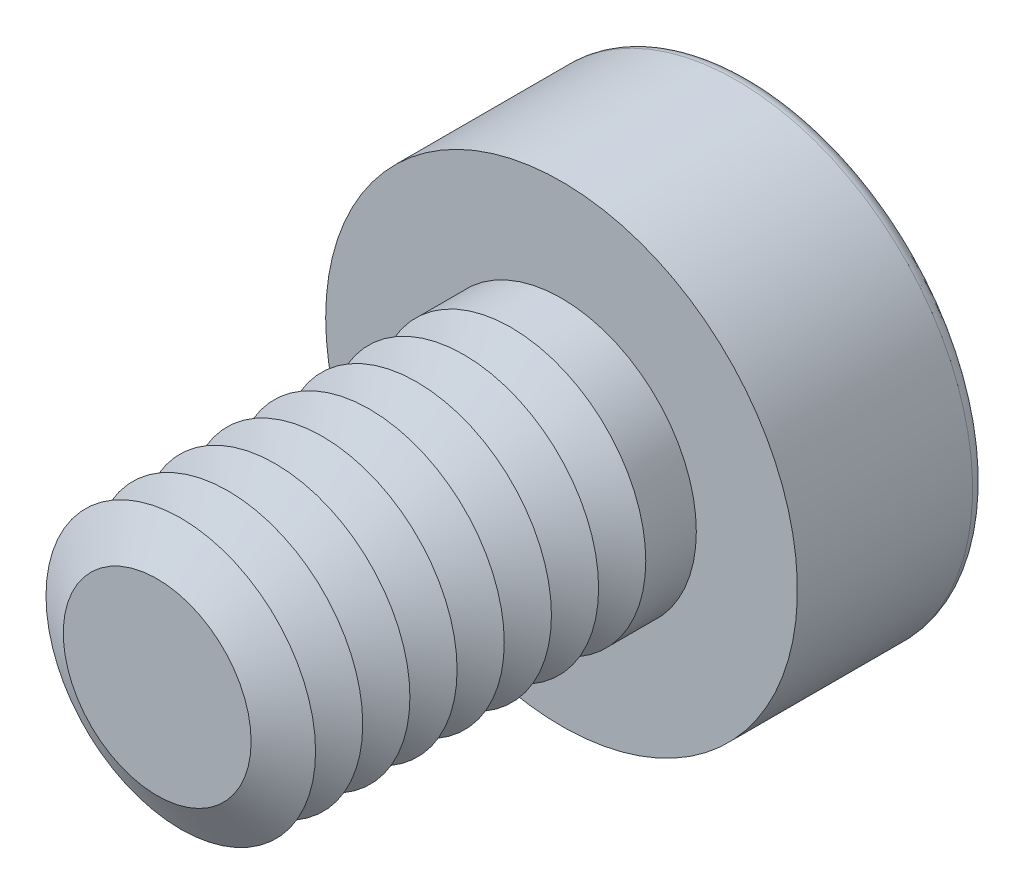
ISO-10303-21;
HEADER;
FILE_DESCRIPTION(('STEP AP214'),'2;1');
FILE_NAME('part.step','',(''),(''),'','','');
FILE_SCHEMA(('AUTOMOTIVE_DESIGN { 1 0 10303 214 1 1 1 1 }'));
ENDSEC;
DATA;
#1=APPLICATION_CONTEXT('core data for automotive mechanical design processes');
#2=APPLICATION_PROTOCOL_DEFINITION('international standard','automotive_design',2000,#1);
#3=PRODUCT_CONTEXT('',#1,'mechanical');
#4=PRODUCT('Part','Part','',(#3));
#5=PRODUCT_RELATED_PRODUCT_CATEGORY('part','',(#4));
#6=PRODUCT_DEFINITION_FORMATION('','',#4);
#7=PRODUCT_DEFINITION_CONTEXT('part definition',#1,'design');
#8=PRODUCT_DEFINITION('design','',#6,#7);
#9=PRODUCT_DEFINITION_SHAPE('','',#8);
#10=(LENGTH_UNIT() NAMED_UNIT(*) SI_UNIT(.MILLI.,.METRE.));
#11=(NAMED_UNIT(*) PLANE_ANGLE_UNIT() SI_UNIT($,.RADIAN.));
#12=(NAMED_UNIT(*) SI_UNIT($,.STERADIAN.) SOLID_ANGLE_UNIT());
#13=UNCERTAINTY_MEASURE_WITH_UNIT(LENGTH_MEASURE(1.E-05),#10,'distance_accuracy_value','');
#14=(GEOMETRIC_REPRESENTATION_CONTEXT(3) GLOBAL_UNCERTAINTY_ASSIGNED_CONTEXT((#13)) GLOBAL_UNIT_ASSIGNED_CONTEXT((#10,
#11,#12)) REPRESENTATION_CONTEXT('',''));
#15=CARTESIAN_POINT('',(0.,0.,0.));
#16=DIRECTION('',(0.,0.,1.));
#17=DIRECTION('',(1.,0.,0.));
#18=AXIS2_PLACEMENT_3D('',#15,#16,#17);
#19=CARTESIAN_POINT('',(0.,0.,3.54999999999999));
#20=DIRECTION('',(0.,0.,1.));
#21=DIRECTION('',(1.,0.,0.));
#22=AXIS2_PLACEMENT_3D('',#19,#20,#21);
#23=CONICAL_SURFACE('',#22,2.,1.0471975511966);
#24=CARTESIAN_POINT('',(0.,0.,3.2));
#25=DIRECTION('',(0.,0.,1.));
#26=DIRECTION('',(1.,0.,0.));
#27=AXIS2_PLACEMENT_3D('',#24,#25,#26);
#28=CIRCLE('',#27,1.39378221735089);
#29=CARTESIAN_POINT('',(1.39378221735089,0.,3.2));
#30=VERTEX_POINT('',#29);
#31=EDGE_CURVE('E314',#30,#30,#28,.T.);
#32=ORIENTED_EDGE('',*,*,#31,.T.);
#33=EDGE_LOOP('',(#32));
#34=FACE_BOUND('',#33,.T.);
#35=CARTESIAN_POINT('',(0.,0.,3.54999999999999));
#36=DIRECTION('',(0.,0.,1.));
#37=DIRECTION('',(1.,0.,0.));
#38=AXIS2_PLACEMENT_3D('',#35,#36,#37);
#39=CIRCLE('',#38,2.);
#40=CARTESIAN_POINT('',(2.,0.,3.54999999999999));
#41=VERTEX_POINT('',#40);
#42=EDGE_CURVE('E317',#41,#41,#39,.T.);
#43=ORIENTED_EDGE('',*,*,#42,.F.);
#44=EDGE_LOOP('',(#43));
#45=FACE_BOUND('',#44,.T.);
#46=ADVANCED_FACE('F39',(#34,#45),#23,.T.);
#47=CARTESIAN_POINT('',(0.,0.,3.2));
#48=DIRECTION('',(0.,0.,-1.));
#49=DIRECTION('',(-1.,0.,0.));
#50=AXIS2_PLACEMENT_3D('',#47,#48,#49);
#51=CONICAL_SURFACE('',#50,1.39378221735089,1.04719755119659);
#52=CARTESIAN_POINT('',(0.,0.,2.84999999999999));
#53=DIRECTION('',(0.,0.,1.));
#54=DIRECTION('',(1.,0.,0.));
#55=AXIS2_PLACEMENT_3D('',#52,#53,#54);
#56=CIRCLE('',#55,2.);
#57=CARTESIAN_POINT('',(2.,0.,2.84999999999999));
#58=VERTEX_POINT('',#57);
#59=EDGE_CURVE('E324',#58,#58,#56,.T.);
#60=ORIENTED_EDGE('',*,*,#59,.T.);
#61=EDGE_LOOP('',(#60));
#62=FACE_BOUND('',#61,.T.);
#63=ORIENTED_EDGE('',*,*,#31,.F.);
#64=EDGE_LOOP('',(#63));
#65=FACE_BOUND('',#64,.T.);
#66=ADVANCED_FACE('F245',(#62,#65),#51,.T.);
#67=CARTESIAN_POINT('',(0.,0.,6.));
#68=DIRECTION('',(0.,0.,1.));
#69=DIRECTION('',(1.,0.,0.));
#70=AXIS2_PLACEMENT_3D('',#67,#68,#69);
#71=PLANE('',#70);
#72=CARTESIAN_POINT('',(0.,0.,6.));
#73=DIRECTION('',(0.,0.,1.));
#74=DIRECTION('',(1.,0.,0.));
#75=AXIS2_PLACEMENT_3D('',#72,#73,#74);
#76=CIRCLE('',#75,1.39378221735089);
#77=CARTESIAN_POINT('',(1.39378221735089,0.,6.));
#78=VERTEX_POINT('',#77);
#79=EDGE_CURVE('E174',#78,#78,#76,.T.);
#80=ORIENTED_EDGE('',*,*,#79,.T.);
#81=EDGE_LOOP('',(#80));
#82=FACE_BOUND('',#81,.T.);
#83=ADVANCED_FACE('F251',(#82),#71,.T.);
#84=CARTESIAN_POINT('',(0.,0.,6.));
#85=DIRECTION('',(0.,0.,-1.));
#86=DIRECTION('',(-1.,0.,0.));
#87=AXIS2_PLACEMENT_3D('',#84,#85,#86);
#88=CONICAL_SURFACE('',#87,1.39378221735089,1.04719755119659);
#89=CARTESIAN_POINT('',(0.,0.,5.64999999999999));
#90=DIRECTION('',(0.,0.,1.));
#91=DIRECTION('',(1.,0.,0.));
#92=AXIS2_PLACEMENT_3D('',#89,#90,#91);
#93=CIRCLE('',#92,2.);
#94=CARTESIAN_POINT('',(2.,0.,5.64999999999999));
#95=VERTEX_POINT('',#94);
#96=EDGE_CURVE('E291',#95,#95,#93,.T.);
#97=ORIENTED_EDGE('',*,*,#96,.T.);
#98=EDGE_LOOP('',(#97));
#99=FACE_BOUND('',#98,.T.);
#100=ORIENTED_EDGE('',*,*,#79,.F.);
#101=EDGE_LOOP('',(#100));
#102=FACE_BOUND('',#101,.T.);
#103=ADVANCED_FACE('F199',(#99,#102),#88,.T.);
#104=CARTESIAN_POINT('',(0.,0.,5.64999999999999));
#105=DIRECTION('',(0.,0.,1.));
#106=DIRECTION('',(1.,0.,0.));
#107=AXIS2_PLACEMENT_3D('',#104,#105,#106);
#108=CONICAL_SURFACE('',#107,2.,1.0471975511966);
#109=CARTESIAN_POINT('',(0.,0.,5.3));
#110=DIRECTION('',(0.,0.,1.));
#111=DIRECTION('',(1.,0.,0.));
#112=AXIS2_PLACEMENT_3D('',#109,#110,#111);
#113=CIRCLE('',#112,1.39378221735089);
#114=CARTESIAN_POINT('',(1.39378221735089,0.,5.3));
#115=VERTEX_POINT('',#114);
#116=EDGE_CURVE('E288',#115,#115,#113,.T.);
#117=ORIENTED_EDGE('',*,*,#116,.T.);
#118=EDGE_LOOP('',(#117));
#119=FACE_BOUND('',#118,.T.);
#120=ORIENTED_EDGE('',*,*,#96,.F.);
#121=EDGE_LOOP('',(#120));
#122=FACE_BOUND('',#121,.T.);
#123=ADVANCED_FACE('F277',(#119,#122),#108,.T.);
#124=CARTESIAN_POINT('',(0.,0.,5.3));
#125=DIRECTION('',(0.,0.,-1.));
#126=DIRECTION('',(-1.,0.,0.));
#127=AXIS2_PLACEMENT_3D('',#124,#125,#126);
#128=CONICAL_SURFACE('',#127,1.39378221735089,1.04719755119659);
#129=CARTESIAN_POINT('',(0.,0.,4.94999999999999));
#130=DIRECTION('',(0.,0.,1.));
#131=DIRECTION('',(1.,0.,0.));
#132=AXIS2_PLACEMENT_3D('',#129,#130,#131);
#133=CIRCLE('',#132,2.);
#134=CARTESIAN_POINT('',(2.,0.,4.94999999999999));
#135=VERTEX_POINT('',#134);
#136=EDGE_CURVE('E300',#135,#135,#133,.T.);
#137=ORIENTED_EDGE('',*,*,#136,.T.);
#138=EDGE_LOOP('',(#137));
#139=FACE_BOUND('',#138,.T.);
#140=ORIENTED_EDGE('',*,*,#116,.F.);
#141=EDGE_LOOP('',(#140));
#142=FACE_BOUND('',#141,.T.);
#143=ADVANCED_FACE('F274',(#139,#142),#128,.T.);
#144=CARTESIAN_POINT('',(0.,0.,4.94999999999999));
#145=DIRECTION('',(0.,0.,1.));
#146=DIRECTION('',(1.,0.,0.));
#147=AXIS2_PLACEMENT_3D('',#144,#145,#146);
#148=CONICAL_SURFACE('',#147,2.,1.0471975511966);
#149=CARTESIAN_POINT('',(0.,0.,4.6));
#150=DIRECTION('',(0.,0.,1.));
#151=DIRECTION('',(1.,0.,0.));
#152=AXIS2_PLACEMENT_3D('',#149,#150,#151);
#153=CIRCLE('',#152,1.39378221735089);
#154=CARTESIAN_POINT('',(1.39378221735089,0.,4.6));
#155=VERTEX_POINT('',#154);
#156=EDGE_CURVE('E293',#155,#155,#153,.T.);
#157=ORIENTED_EDGE('',*,*,#156,.T.);
#158=EDGE_LOOP('',(#157));
#159=FACE_BOUND('',#158,.T.);
#160=ORIENTED_EDGE('',*,*,#136,.F.);
#161=EDGE_LOOP('',(#160));
#162=FACE_BOUND('',#161,.T.);
#163=ADVANCED_FACE('F270',(#159,#162),#148,.T.);
#164=CARTESIAN_POINT('',(0.,0.,4.6));
#165=DIRECTION('',(0.,0.,-1.));
#166=DIRECTION('',(-1.,0.,0.));
#167=AXIS2_PLACEMENT_3D('',#164,#165,#166);
#168=CONICAL_SURFACE('',#167,1.39378221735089,1.04719755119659);
#169=CARTESIAN_POINT('',(0.,0.,4.24999999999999));
#170=DIRECTION('',(0.,0.,1.));
#171=DIRECTION('',(1.,0.,0.));
#172=AXIS2_PLACEMENT_3D('',#169,#170,#171);
#173=CIRCLE('',#172,2.);
#174=CARTESIAN_POINT('',(2.,0.,4.24999999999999));
#175=VERTEX_POINT('',#174);
#176=EDGE_CURVE('E310',#175,#175,#173,.T.);
#177=ORIENTED_EDGE('',*,*,#176,.T.);
#178=EDGE_LOOP('',(#177));
#179=FACE_BOUND('',#178,.T.);
#180=ORIENTED_EDGE('',*,*,#156,.F.);
#181=EDGE_LOOP('',(#180));
#182=FACE_BOUND('',#181,.T.);
#183=ADVANCED_FACE('F266',(#179,#182),#168,.T.);
#184=CARTESIAN_POINT('',(0.,0.,4.24999999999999));
#185=DIRECTION('',(0.,0.,1.));
#186=DIRECTION('',(1.,0.,0.));
#187=AXIS2_PLACEMENT_3D('',#184,#185,#186);
#188=CONICAL_SURFACE('',#187,2.,1.0471975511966);
#189=CARTESIAN_POINT('',(0.,0.,3.9));
#190=DIRECTION('',(0.,0.,1.));
#191=DIRECTION('',(1.,0.,0.));
#192=AXIS2_PLACEMENT_3D('',#189,#190,#191);
#193=CIRCLE('',#192,1.39378221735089);
#194=CARTESIAN_POINT('',(1.39378221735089,0.,3.9));
#195=VERTEX_POINT('',#194);
#196=EDGE_CURVE('E306',#195,#195,#193,.T.);
#197=ORIENTED_EDGE('',*,*,#196,.T.);
#198=EDGE_LOOP('',(#197));
#199=FACE_BOUND('',#198,.T.);
#200=ORIENTED_EDGE('',*,*,#176,.F.);
#201=EDGE_LOOP('',(#200));
#202=FACE_BOUND('',#201,.T.);
#203=ADVANCED_FACE('F262',(#199,#202),#188,.T.);
#204=CARTESIAN_POINT('',(0.,0.,3.9));
#205=DIRECTION('',(0.,0.,-1.));
#206=DIRECTION('',(-1.,0.,0.));
#207=AXIS2_PLACEMENT_3D('',#204,#205,#206);
#208=CONICAL_SURFACE('',#207,1.39378221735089,1.04719755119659);
#209=ORIENTED_EDGE('',*,*,#42,.T.);
#210=EDGE_LOOP('',(#209));
#211=FACE_BOUND('',#210,.T.);
#212=ORIENTED_EDGE('',*,*,#196,.F.);
#213=EDGE_LOOP('',(#212));
#214=FACE_BOUND('',#213,.T.);
#215=ADVANCED_FACE('F258',(#211,#214),#208,.T.);
#216=CARTESIAN_POINT('',(0.,0.,2.84999999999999));
#217=DIRECTION('',(0.,0.,1.));
#218=DIRECTION('',(1.,0.,0.));
#219=AXIS2_PLACEMENT_3D('',#216,#217,#218);
#220=CONICAL_SURFACE('',#219,2.,1.0471975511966);
#221=CARTESIAN_POINT('',(0.,0.,2.5));
#222=DIRECTION('',(0.,0.,1.));
#223=DIRECTION('',(1.,0.,0.));
#224=AXIS2_PLACEMENT_3D('',#221,#222,#223);
#225=CIRCLE('',#224,1.39378221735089);
#226=CARTESIAN_POINT('',(1.39378221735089,0.,2.5));
#227=VERTEX_POINT('',#226);
#228=EDGE_CURVE('E321',#227,#227,#225,.T.);
#229=ORIENTED_EDGE('',*,*,#228,.T.);
#230=EDGE_LOOP('',(#229));
#231=FACE_BOUND('',#230,.T.);
#232=ORIENTED_EDGE('',*,*,#59,.F.);
#233=EDGE_LOOP('',(#232));
#234=FACE_BOUND('',#233,.T.);
#235=ADVANCED_FACE('F261',(#231,#234),#220,.T.);
#236=CARTESIAN_POINT('',(0.,0.,2.5));
#237=DIRECTION('',(0.,0.,-1.));
#238=DIRECTION('',(-1.,0.,0.));
#239=AXIS2_PLACEMENT_3D('',#236,#237,#238);
#240=CONICAL_SURFACE('',#239,1.39378221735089,1.04719755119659);
#241=CARTESIAN_POINT('',(0.,0.,2.14999999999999));
#242=DIRECTION('',(0.,0.,1.));
#243=DIRECTION('',(1.,0.,0.));
#244=AXIS2_PLACEMENT_3D('',#241,#242,#243);
#245=CIRCLE('',#244,2.);
#246=CARTESIAN_POINT('',(2.,0.,2.14999999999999));
#247=VERTEX_POINT('',#246);
#248=EDGE_CURVE('E332',#247,#247,#245,.T.);
#249=ORIENTED_EDGE('',*,*,#248,.T.);
#250=EDGE_LOOP('',(#249));
#251=FACE_BOUND('',#250,.T.);
#252=ORIENTED_EDGE('',*,*,#228,.F.);
#253=EDGE_LOOP('',(#252));
#254=FACE_BOUND('',#253,.T.);
#255=ADVANCED_FACE('F368',(#251,#254),#240,.T.);
#256=CARTESIAN_POINT('',(0.,0.,2.14999999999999));
#257=DIRECTION('',(0.,0.,1.));
#258=DIRECTION('',(1.,0.,0.));
#259=AXIS2_PLACEMENT_3D('',#256,#257,#258);
#260=CONICAL_SURFACE('',#259,2.,1.0471975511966);
#261=CARTESIAN_POINT('',(0.,0.,1.8));
#262=DIRECTION('',(0.,0.,1.));
#263=DIRECTION('',(1.,0.,0.));
#264=AXIS2_PLACEMENT_3D('',#261,#262,#263);
#265=CIRCLE('',#264,1.39378221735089);
#266=CARTESIAN_POINT('',(1.39378221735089,0.,1.8));
#267=VERTEX_POINT('',#266);
#268=EDGE_CURVE('E328',#267,#267,#265,.T.);
#269=ORIENTED_EDGE('',*,*,#268,.T.);
#270=EDGE_LOOP('',(#269));
#271=FACE_BOUND('',#270,.T.);
#272=ORIENTED_EDGE('',*,*,#248,.F.);
#273=EDGE_LOOP('',(#272));
#274=FACE_BOUND('',#273,.T.);
#275=ADVANCED_FACE('F363',(#271,#274),#260,.T.);
#276=CARTESIAN_POINT('',(0.,0.,1.8));
#277=DIRECTION('',(0.,0.,-1.));
#278=DIRECTION('',(-1.,0.,0.));
#279=AXIS2_PLACEMENT_3D('',#276,#277,#278);
#280=CONICAL_SURFACE('',#279,1.39378221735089,1.04719755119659);
#281=CARTESIAN_POINT('',(0.,0.,1.44999999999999));
#282=DIRECTION('',(0.,0.,1.));
#283=DIRECTION('',(1.,0.,0.));
#284=AXIS2_PLACEMENT_3D('',#281,#282,#283);
#285=CIRCLE('',#284,2.);
#286=CARTESIAN_POINT('',(2.,0.,1.44999999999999));
#287=VERTEX_POINT('',#286);
#288=EDGE_CURVE('E344',#287,#287,#285,.T.);
#289=ORIENTED_EDGE('',*,*,#288,.T.);
#290=EDGE_LOOP('',(#289));
#291=FACE_BOUND('',#290,.T.);
#292=ORIENTED_EDGE('',*,*,#268,.F.);
#293=EDGE_LOOP('',(#292));
#294=FACE_BOUND('',#293,.T.);
#295=ADVANCED_FACE('F349',(#291,#294),#280,.T.);
#296=CARTESIAN_POINT('',(0.,0.,1.44999999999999));
#297=DIRECTION('',(0.,0.,1.));
#298=DIRECTION('',(1.,0.,0.));
#299=AXIS2_PLACEMENT_3D('',#296,#297,#298);
#300=CONICAL_SURFACE('',#299,2.,1.0471975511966);
#301=CARTESIAN_POINT('',(0.,0.,1.1));
#302=DIRECTION('',(0.,0.,1.));
#303=DIRECTION('',(1.,0.,0.));
#304=AXIS2_PLACEMENT_3D('',#301,#302,#303);
#305=CIRCLE('',#304,1.39378221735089);
#306=CARTESIAN_POINT('',(1.39378221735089,0.,1.1));
#307=VERTEX_POINT('',#306);
#308=EDGE_CURVE('E336',#307,#307,#305,.T.);
#309=ORIENTED_EDGE('',*,*,#308,.T.);
#310=EDGE_LOOP('',(#309));
#311=FACE_BOUND('',#310,.T.);
#312=ORIENTED_EDGE('',*,*,#288,.F.);
#313=EDGE_LOOP('',(#312));
#314=FACE_BOUND('',#313,.T.);
#315=ADVANCED_FACE('F352',(#311,#314),#300,.T.);
#316=CARTESIAN_POINT('',(0.,0.,1.1));
#317=DIRECTION('',(0.,0.,-1.));
#318=DIRECTION('',(-1.,0.,0.));
#319=AXIS2_PLACEMENT_3D('',#316,#317,#318);
#320=CONICAL_SURFACE('',#319,1.39378221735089,1.04719755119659);
#321=CARTESIAN_POINT('',(0.,0.,0.749999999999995));
#322=DIRECTION('',(0.,0.,1.));
#323=DIRECTION('',(1.,0.,0.));
#324=AXIS2_PLACEMENT_3D('',#321,#322,#323);
#325=CIRCLE('',#324,2.);
#326=CARTESIAN_POINT('',(2.,0.,0.749999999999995));
#327=VERTEX_POINT('',#326);
#328=EDGE_CURVE('E340',#327,#327,#325,.T.);
#329=ORIENTED_EDGE('',*,*,#328,.T.);
#330=EDGE_LOOP('',(#329));
#331=FACE_BOUND('',#330,.T.);
#332=ORIENTED_EDGE('',*,*,#308,.F.);
#333=EDGE_LOOP('',(#332));
#334=FACE_BOUND('',#333,.T.);
#335=ADVANCED_FACE('F354',(#331,#334),#320,.T.);
#336=CARTESIAN_POINT('',(0.,0.,-0.925));
#337=DIRECTION('',(0.,0.,-1.));
#338=DIRECTION('',(-1.,0.,0.));
#339=AXIS2_PLACEMENT_3D('',#336,#337,#338);
#340=CONICAL_SURFACE('',#339,1.25,1.0471975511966);
#341=CARTESIAN_POINT('',(0.,0.,-0.203312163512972));
#342=VERTEX_POINT('',#341);
#343=VERTEX_LOOP('',#342);
#344=FACE_BOUND('',#343,.T.);
#345=CARTESIAN_POINT('',(0.,0.,-0.925));
#346=DIRECTION('',(0.,0.,-1.));
#347=DIRECTION('',(-1.,0.,0.));
#348=AXIS2_PLACEMENT_3D('',#345,#346,#347);
#349=CIRCLE('',#348,1.25);
#350=CARTESIAN_POINT('',(-1.08253175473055,0.625,-0.925));
#351=VERTEX_POINT('',#350);
#352=CARTESIAN_POINT('',(0.,1.25,-0.925));
#353=VERTEX_POINT('',#352);
#354=EDGE_CURVE('E149',#351,#353,#349,.T.);
#355=ORIENTED_EDGE('',*,*,#354,.T.);
#356=CARTESIAN_POINT('',(0.,0.,-0.925));
#357=DIRECTION('',(0.,0.,-1.));
#358=DIRECTION('',(-1.,0.,0.));
#359=AXIS2_PLACEMENT_3D('',#356,#357,#358);
#360=CIRCLE('',#359,1.25);
#361=CARTESIAN_POINT('',(1.08253175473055,0.625,-0.925));
#362=VERTEX_POINT('',#361);
#363=EDGE_CURVE('E54',#353,#362,#360,.T.);
#364=ORIENTED_EDGE('',*,*,#363,.T.);
#365=CARTESIAN_POINT('',(1.08253175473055,-0.625,-0.925));
#366=VERTEX_POINT('',#365);
#367=EDGE_CURVE('E756',#362,#366,#360,.T.);
#368=ORIENTED_EDGE('',*,*,#367,.T.);
#369=CARTESIAN_POINT('',(0.,-1.25,-0.925));
#370=VERTEX_POINT('',#369);
#371=EDGE_CURVE('E754',#366,#370,#360,.T.);
#372=ORIENTED_EDGE('',*,*,#371,.T.);
#373=CARTESIAN_POINT('',(-1.08253175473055,-0.625,-0.925));
#374=VERTEX_POINT('',#373);
#375=EDGE_CURVE('E748',#370,#374,#360,.T.);
#376=ORIENTED_EDGE('',*,*,#375,.T.);
#377=EDGE_CURVE('E747',#374,#351,#360,.T.);
#378=ORIENTED_EDGE('',*,*,#377,.T.);
#379=EDGE_LOOP('',(#355,#364,#368,#372,#376,#378));
#380=FACE_BOUND('',#379,.T.);
#381=ADVANCED_FACE('F201',(#344,#380),#340,.F.);
#382=CARTESIAN_POINT('',(0.,0.,-0.925));
#383=DIRECTION('',(0.,0.,-1.));
#384=DIRECTION('',(-1.,0.,0.));
#385=AXIS2_PLACEMENT_3D('',#382,#383,#384);
#386=PLANE('',#385);
#387=ORIENTED_EDGE('',*,*,#363,.F.);
#388=DIRECTION('',(1.,0.,0.));
#389=VECTOR('',#388,1.);
#390=CARTESIAN_POINT('',(-0.721687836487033,1.25,-0.925));
#391=LINE('',#390,#389);
#392=CARTESIAN_POINT('',(0.721687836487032,1.25,-0.925));
#393=VERTEX_POINT('',#392);
#394=EDGE_CURVE('E793',#353,#393,#391,.T.);
#395=ORIENTED_EDGE('',*,*,#394,.T.);
#396=DIRECTION('',(0.5,-0.866025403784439,0.));
#397=VECTOR('',#396,1.);
#398=CARTESIAN_POINT('',(0.721687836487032,1.25,-0.925));
#399=LINE('',#398,#397);
#400=EDGE_CURVE('E155',#393,#362,#399,.T.);
#401=ORIENTED_EDGE('',*,*,#400,.T.);
#402=EDGE_LOOP('',(#387,#395,#401));
#403=FACE_BOUND('',#402,.T.);
#404=ADVANCED_FACE('F409',(#403),#386,.T.);
#405=ORIENTED_EDGE('',*,*,#367,.F.);
#406=CARTESIAN_POINT('',(1.44337567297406,0.,-0.925));
#407=VERTEX_POINT('',#406);
#408=EDGE_CURVE('E797',#362,#407,#399,.T.);
#409=ORIENTED_EDGE('',*,*,#408,.T.);
#410=DIRECTION('',(-0.5,-0.866025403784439,0.));
#411=VECTOR('',#410,1.);
#412=CARTESIAN_POINT('',(1.44337567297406,0.,-0.925));
#413=LINE('',#412,#411);
#414=EDGE_CURVE('E766',#407,#366,#413,.T.);
#415=ORIENTED_EDGE('',*,*,#414,.T.);
#416=EDGE_LOOP('',(#405,#409,#415));
#417=FACE_BOUND('',#416,.T.);
#418=ADVANCED_FACE('F419',(#417),#386,.T.);
#419=ORIENTED_EDGE('',*,*,#371,.F.);
#420=CARTESIAN_POINT('',(0.721687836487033,-1.25,-0.925));
#421=VERTEX_POINT('',#420);
#422=EDGE_CURVE('E768',#366,#421,#413,.T.);
#423=ORIENTED_EDGE('',*,*,#422,.T.);
#424=DIRECTION('',(-1.,0.,0.));
#425=VECTOR('',#424,1.);
#426=CARTESIAN_POINT('',(0.721687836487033,-1.25,-0.925));
#427=LINE('',#426,#425);
#428=EDGE_CURVE('E722',#421,#370,#427,.T.);
#429=ORIENTED_EDGE('',*,*,#428,.T.);
#430=EDGE_LOOP('',(#419,#423,#429));
#431=FACE_BOUND('',#430,.T.);
#432=ADVANCED_FACE('F429',(#431),#386,.T.);
#433=ORIENTED_EDGE('',*,*,#375,.F.);
#434=CARTESIAN_POINT('',(-0.721687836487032,-1.25,-0.925));
#435=VERTEX_POINT('',#434);
#436=EDGE_CURVE('E763',#370,#435,#427,.T.);
#437=ORIENTED_EDGE('',*,*,#436,.T.);
#438=DIRECTION('',(-0.5,0.866025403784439,0.));
#439=VECTOR('',#438,1.);
#440=CARTESIAN_POINT('',(-0.721687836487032,-1.25,-0.925));
#441=LINE('',#440,#439);
#442=EDGE_CURVE('E765',#435,#374,#441,.T.);
#443=ORIENTED_EDGE('',*,*,#442,.T.);
#444=EDGE_LOOP('',(#433,#437,#443));
#445=FACE_BOUND('',#444,.T.);
#446=ADVANCED_FACE('F437',(#445),#386,.T.);
#447=ORIENTED_EDGE('',*,*,#377,.F.);
#448=CARTESIAN_POINT('',(-1.44337567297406,0.,-0.925));
#449=VERTEX_POINT('',#448);
#450=EDGE_CURVE('E770',#374,#449,#441,.T.);
#451=ORIENTED_EDGE('',*,*,#450,.T.);
#452=DIRECTION('',(0.5,0.866025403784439,0.));
#453=VECTOR('',#452,1.);
#454=CARTESIAN_POINT('',(-1.44337567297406,0.,-0.925));
#455=LINE('',#454,#453);
#456=EDGE_CURVE('E158',#449,#351,#455,.T.);
#457=ORIENTED_EDGE('',*,*,#456,.T.);
#458=EDGE_LOOP('',(#447,#451,#457));
#459=FACE_BOUND('',#458,.T.);
#460=ADVANCED_FACE('F231',(#459),#386,.T.);
#461=ORIENTED_EDGE('',*,*,#354,.F.);
#462=CARTESIAN_POINT('',(-0.721687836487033,1.25,-0.925));
#463=VERTEX_POINT('',#462);
#464=EDGE_CURVE('E778',#351,#463,#455,.T.);
#465=ORIENTED_EDGE('',*,*,#464,.T.);
#466=EDGE_CURVE('E792',#463,#353,#391,.T.);
#467=ORIENTED_EDGE('',*,*,#466,.T.);
#468=EDGE_LOOP('',(#461,#465,#467));
#469=FACE_BOUND('',#468,.T.);
#470=ADVANCED_FACE('F421',(#469),#386,.T.);
#471=CARTESIAN_POINT('',(-0.721687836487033,1.25,-0.925));
#472=DIRECTION('',(0.,1.,0.));
#473=DIRECTION('',(0.,0.,1.));
#474=AXIS2_PLACEMENT_3D('',#471,#472,#473);
#475=PLANE('',#474);
#476=DIRECTION('',(0.,0.,-1.));
#477=VECTOR('',#476,1.);
#478=CARTESIAN_POINT('',(-0.721687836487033,1.25,-0.925));
#479=LINE('',#478,#477);
#480=CARTESIAN_POINT('',(-0.721687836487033,1.25,-2.8));
#481=VERTEX_POINT('',#480);
#482=EDGE_CURVE('E147',#463,#481,#479,.T.);
#483=ORIENTED_EDGE('',*,*,#482,.T.);
#484=CARTESIAN_POINT('',(-1.88400474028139,1.25,-3.01907305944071));
#485=CARTESIAN_POINT('',(-1.82756112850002,1.25,-3.00647265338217));
#486=CARTESIAN_POINT('',(-1.77108164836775,1.25,-2.99403280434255));
#487=CARTESIAN_POINT('',(-1.65803301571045,1.25,-2.969555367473));
#488=CARTESIAN_POINT('',(-1.60146385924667,1.25,-2.95751779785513));
#489=CARTESIAN_POINT('',(-1.43148763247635,1.25,-2.92210797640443));
#490=CARTESIAN_POINT('',(-1.31792638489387,1.25,-2.89946453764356));
#491=CARTESIAN_POINT('',(-1.09123200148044,1.25,-2.85732379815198));
#492=CARTESIAN_POINT('',(-0.978103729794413,1.25,-2.83780085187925));
#493=CARTESIAN_POINT('',(-0.751170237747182,1.25,-2.80320860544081));
#494=CARTESIAN_POINT('',(-0.637365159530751,1.25,-2.78813840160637));
#495=CARTESIAN_POINT('',(-0.407744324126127,1.25,-2.76441002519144));
#496=CARTESIAN_POINT('',(-0.291920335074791,1.25,-2.7558257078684));
#497=CARTESIAN_POINT('',(-0.117976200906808,1.25,-2.74931804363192));
#498=CARTESIAN_POINT('',(-0.0599690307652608,1.25,-2.74820997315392));
#499=CARTESIAN_POINT('',(0.0560463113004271,1.25,-2.74816114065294));
#500=CARTESIAN_POINT('',(0.114054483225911,1.25,-2.74922038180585));
#501=CARTESIAN_POINT('',(0.288428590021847,1.25,-2.75560214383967));
#502=CARTESIAN_POINT('',(0.40468303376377,1.25,-2.76414565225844));
#503=CARTESIAN_POINT('',(0.63652474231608,1.25,-2.78800009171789));
#504=CARTESIAN_POINT('',(0.752111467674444,1.25,-2.80331588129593));
#505=CARTESIAN_POINT('',(0.98558577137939,1.25,-2.83897937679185));
#506=CARTESIAN_POINT('',(1.10345418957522,1.25,-2.85944851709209));
#507=CARTESIAN_POINT('',(1.3386179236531,1.25,-2.90348104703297));
#508=CARTESIAN_POINT('',(1.45591314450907,1.25,-2.92704493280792));
#509=CARTESIAN_POINT('',(1.69011362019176,1.25,-2.97617760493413));
#510=CARTESIAN_POINT('',(1.80701875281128,1.25,-3.00174696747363));
#511=CARTESIAN_POINT('',(2.04053091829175,1.25,-3.05421495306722));
#512=CARTESIAN_POINT('',(2.15713794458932,1.25,-3.08111360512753));
#513=CARTESIAN_POINT('',(2.38871499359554,1.25,-3.13548950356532));
#514=CARTESIAN_POINT('',(2.50368762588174,1.25,-3.16295568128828));
#515=CARTESIAN_POINT('',(2.73348169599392,1.25,-3.21852313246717));
#516=CARTESIAN_POINT('',(2.8483031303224,1.25,-3.2466244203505));
#517=CARTESIAN_POINT('',(3.07767157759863,1.25,-3.3032502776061));
#518=CARTESIAN_POINT('',(3.19221874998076,1.25,-3.33177420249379));
#519=CARTESIAN_POINT('',(3.4212203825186,1.25,-3.38917462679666));
#520=CARTESIAN_POINT('',(3.53567484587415,1.25,-3.41805111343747));
#521=CARTESIAN_POINT('',(3.65009781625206,1.25,-3.44705046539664));
#522=B_SPLINE_CURVE_WITH_KNOTS('',3,(#484,#485,#486,#487,#488,#489,#490,#491,#492,#493,#494,
#495,#496,#497,#498,#499,#500,#501,#502,#503,#504,#505,#506,#507,#508,#509,#510,#511,#512,#513,
#514,#515,#516,#517,#518,#519,#520,#521),.UNSPECIFIED.,.F.,.F.,(4,2,2,2,2,2,2,2,2,2,2,2,2,2,2,2,
2,2,4),(0.,0.173498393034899,0.347004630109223,0.694369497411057,1.03871380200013,
1.38298817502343,1.73112607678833,1.90514173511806,2.07915764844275,2.42857002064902,
2.77823347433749,3.13706733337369,3.49595878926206,3.85495373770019,4.21395652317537,
4.56857767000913,4.92320688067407,5.27734186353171,5.63146405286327),.UNSPECIFIED.);
#523=CARTESIAN_POINT('',(0.721687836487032,1.25,-2.8));
#524=VERTEX_POINT('',#523);
#525=EDGE_CURVE('E124',#481,#524,#522,.T.);
#526=ORIENTED_EDGE('',*,*,#525,.T.);
#527=DIRECTION('',(0.,0.,-1.));
#528=VECTOR('',#527,1.);
#529=CARTESIAN_POINT('',(0.721687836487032,1.25,-0.925));
#530=LINE('',#529,#528);
#531=EDGE_CURVE('E143',#393,#524,#530,.T.);
#532=ORIENTED_EDGE('',*,*,#531,.F.);
#533=ORIENTED_EDGE('',*,*,#394,.F.);
#534=ORIENTED_EDGE('',*,*,#466,.F.);
#535=EDGE_LOOP('',(#483,#526,#532,#533,#534));
#536=FACE_BOUND('',#535,.T.);
#537=ADVANCED_FACE('F141',(#536),#475,.F.);
#538=CARTESIAN_POINT('',(0.721687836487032,1.25,-0.925));
#539=DIRECTION('',(0.866025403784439,0.5,0.));
#540=DIRECTION('',(-0.5,0.866025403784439,0.));
#541=AXIS2_PLACEMENT_3D('',#538,#539,#540);
#542=PLANE('',#541);
#543=ORIENTED_EDGE('',*,*,#531,.T.);
#544=CARTESIAN_POINT('',(0.721572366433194,1.2502,-2.80003094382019));
#545=CARTESIAN_POINT('',(0.75155180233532,1.19827409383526,-2.79199301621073));
#546=CARTESIAN_POINT('',(0.781585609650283,1.14625401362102,-2.78469578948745));
#547=CARTESIAN_POINT('',(0.841759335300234,1.04203006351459,-2.7718751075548));
#548=CARTESIAN_POINT('',(0.871899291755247,0.989826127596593,-2.76635237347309));
#549=CARTESIAN_POINT('',(0.932102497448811,0.885551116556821,-2.75740321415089));
#550=CARTESIAN_POINT('',(0.96216533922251,0.83348074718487,-2.75396611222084));
#551=CARTESIAN_POINT('',(1.0223293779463,0.729273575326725,-2.7493572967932));
#552=CARTESIAN_POINT('',(1.05243056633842,0.677136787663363,-2.74818514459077));
#553=CARTESIAN_POINT('',(1.11263294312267,0.572863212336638,-2.74818514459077));
#554=CARTESIAN_POINT('',(1.1427341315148,0.520726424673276,-2.7493572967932));
#555=CARTESIAN_POINT('',(1.20289817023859,0.416519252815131,-2.75396611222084));
#556=CARTESIAN_POINT('',(1.23296101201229,0.364448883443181,-2.75740321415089));
#557=CARTESIAN_POINT('',(1.29316421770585,0.260173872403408,-2.76635237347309));
#558=CARTESIAN_POINT('',(1.32330417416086,0.207969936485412,-2.7718751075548));
#559=CARTESIAN_POINT('',(1.38347789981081,0.103745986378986,-2.78469578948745));
#560=CARTESIAN_POINT('',(1.41351170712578,0.0517259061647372,-2.79199301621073));
#561=CARTESIAN_POINT('',(1.4434911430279,-0.000199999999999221,-2.80003094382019));
#562=B_SPLINE_CURVE_WITH_KNOTS('',3,(#544,#545,#546,#547,#548,#549,#550,#551,#552,#553,#554,
#555,#556,#557,#558,#559,#560,#561),.UNSPECIFIED.,.F.,.F.,(4,2,2,2,2,2,2,2,4),(0.,
0.18149525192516,0.363064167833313,0.543695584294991,0.724292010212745,0.904888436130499,
1.08551985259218,1.26708876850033,1.44858402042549),.UNSPECIFIED.);
#563=CARTESIAN_POINT('',(1.44337567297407,0.,-2.8));
#564=VERTEX_POINT('',#563);
#565=EDGE_CURVE('E11',#524,#564,#562,.T.);
#566=ORIENTED_EDGE('',*,*,#565,.T.);
#567=DIRECTION('',(0.,0.,-1.));
#568=VECTOR('',#567,1.);
#569=CARTESIAN_POINT('',(1.44337567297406,0.,-0.925));
#570=LINE('',#569,#568);
#571=EDGE_CURVE('E157',#407,#564,#570,.T.);
#572=ORIENTED_EDGE('',*,*,#571,.F.);
#573=ORIENTED_EDGE('',*,*,#408,.F.);
#574=ORIENTED_EDGE('',*,*,#400,.F.);
#575=EDGE_LOOP('',(#543,#566,#572,#573,#574));
#576=FACE_BOUND('',#575,.T.);
#577=ADVANCED_FACE('F152',(#576),#542,.F.);
#578=CARTESIAN_POINT('',(1.44337567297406,0.,-0.925));
#579=DIRECTION('',(0.866025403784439,-0.5,0.));
#580=DIRECTION('',(0.5,0.866025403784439,0.));
#581=AXIS2_PLACEMENT_3D('',#578,#579,#580);
#582=PLANE('',#581);
#583=ORIENTED_EDGE('',*,*,#571,.T.);
#584=CARTESIAN_POINT('',(1.4434911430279,0.000200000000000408,-2.80003094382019));
#585=CARTESIAN_POINT('',(1.41351170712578,-0.0517259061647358,-2.79199301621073));
#586=CARTESIAN_POINT('',(1.38347789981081,-0.103745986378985,-2.78469578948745));
#587=CARTESIAN_POINT('',(1.32330417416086,-0.207969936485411,-2.7718751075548));
#588=CARTESIAN_POINT('',(1.29316421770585,-0.260173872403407,-2.76635237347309));
#589=CARTESIAN_POINT('',(1.23296101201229,-0.36444888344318,-2.75740321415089));
#590=CARTESIAN_POINT('',(1.20289817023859,-0.416519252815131,-2.75396611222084));
#591=CARTESIAN_POINT('',(1.1427341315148,-0.520726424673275,-2.7493572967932));
#592=CARTESIAN_POINT('',(1.11263294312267,-0.572863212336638,-2.74818514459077));
#593=CARTESIAN_POINT('',(1.05243056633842,-0.677136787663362,-2.74818514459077));
#594=CARTESIAN_POINT('',(1.0223293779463,-0.729273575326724,-2.7493572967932));
#595=CARTESIAN_POINT('',(0.96216533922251,-0.833480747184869,-2.75396611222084));
#596=CARTESIAN_POINT('',(0.932102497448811,-0.88555111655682,-2.75740321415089));
#597=CARTESIAN_POINT('',(0.871899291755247,-0.989826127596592,-2.76635237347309));
#598=CARTESIAN_POINT('',(0.841759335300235,-1.04203006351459,-2.7718751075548));
#599=CARTESIAN_POINT('',(0.781585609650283,-1.14625401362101,-2.78469578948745));
#600=CARTESIAN_POINT('',(0.751551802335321,-1.19827409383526,-2.79199301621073));
#601=CARTESIAN_POINT('',(0.721572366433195,-1.2502,-2.80003094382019));
#602=B_SPLINE_CURVE_WITH_KNOTS('',3,(#584,#585,#586,#587,#588,#589,#590,#591,#592,#593,#594,
#595,#596,#597,#598,#599,#600,#601),.UNSPECIFIED.,.F.,.F.,(4,2,2,2,2,2,2,2,4),(0.,
0.18149525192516,0.363064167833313,0.543695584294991,0.724292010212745,0.904888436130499,
1.08551985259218,1.26708876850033,1.44858402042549),.UNSPECIFIED.);
#603=CARTESIAN_POINT('',(0.721687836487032,-1.25,-2.8));
#604=VERTEX_POINT('',#603);
#605=EDGE_CURVE('E173',#564,#604,#602,.T.);
#606=ORIENTED_EDGE('',*,*,#605,.T.);
#607=DIRECTION('',(0.,0.,-1.));
#608=VECTOR('',#607,1.);
#609=CARTESIAN_POINT('',(0.721687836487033,-1.25,-0.925));
#610=LINE('',#609,#608);
#611=EDGE_CURVE('E717',#421,#604,#610,.T.);
#612=ORIENTED_EDGE('',*,*,#611,.F.);
#613=ORIENTED_EDGE('',*,*,#422,.F.);
#614=ORIENTED_EDGE('',*,*,#414,.F.);
#615=EDGE_LOOP('',(#583,#606,#612,#613,#614));
#616=FACE_BOUND('',#615,.T.);
#617=ADVANCED_FACE('F191',(#616),#582,.F.);
#618=CARTESIAN_POINT('',(0.721687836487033,-1.25,-0.925));
#619=DIRECTION('',(0.,-1.,0.));
#620=DIRECTION('',(0.,0.,-1.));
#621=AXIS2_PLACEMENT_3D('',#618,#619,#620);
#622=PLANE('',#621);
#623=ORIENTED_EDGE('',*,*,#611,.T.);
#624=CARTESIAN_POINT('',(-1.88400474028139,-1.25,-3.01907305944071));
#625=CARTESIAN_POINT('',(-1.82756112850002,-1.25,-3.00647265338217));
#626=CARTESIAN_POINT('',(-1.77108164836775,-1.25,-2.99403280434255));
#627=CARTESIAN_POINT('',(-1.65803301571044,-1.25,-2.969555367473));
#628=CARTESIAN_POINT('',(-1.60146385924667,-1.25,-2.95751779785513));
#629=CARTESIAN_POINT('',(-1.43148763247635,-1.25,-2.92210797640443));
#630=CARTESIAN_POINT('',(-1.31792638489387,-1.25,-2.89946453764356));
#631=CARTESIAN_POINT('',(-1.09123200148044,-1.25,-2.85732379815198));
#632=CARTESIAN_POINT('',(-0.978103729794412,-1.25,-2.83780085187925));
#633=CARTESIAN_POINT('',(-0.751170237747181,-1.25,-2.80320860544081));
#634=CARTESIAN_POINT('',(-0.63736515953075,-1.25,-2.78813840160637));
#635=CARTESIAN_POINT('',(-0.407744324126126,-1.25,-2.76441002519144));
#636=CARTESIAN_POINT('',(-0.29192033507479,-1.25,-2.7558257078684));
#637=CARTESIAN_POINT('',(-0.117976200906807,-1.25,-2.74931804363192));
#638=CARTESIAN_POINT('',(-0.0599690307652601,-1.25,-2.74820997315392));
#639=CARTESIAN_POINT('',(0.0560463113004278,-1.25,-2.74816114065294));
#640=CARTESIAN_POINT('',(0.114054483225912,-1.25,-2.74922038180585));
#641=CARTESIAN_POINT('',(0.288428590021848,-1.25,-2.75560214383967));
#642=CARTESIAN_POINT('',(0.40468303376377,-1.25,-2.76414565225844));
#643=CARTESIAN_POINT('',(0.636524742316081,-1.25,-2.78800009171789));
#644=CARTESIAN_POINT('',(0.752111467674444,-1.25,-2.80331588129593));
#645=CARTESIAN_POINT('',(0.985585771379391,-1.25,-2.83897937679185));
#646=CARTESIAN_POINT('',(1.10345418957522,-1.25,-2.85944851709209));
#647=CARTESIAN_POINT('',(1.3386179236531,-1.25,-2.90348104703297));
#648=CARTESIAN_POINT('',(1.45591314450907,-1.25,-2.92704493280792));
#649=CARTESIAN_POINT('',(1.69011362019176,-1.25,-2.97617760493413));
#650=CARTESIAN_POINT('',(1.80701875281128,-1.25,-3.00174696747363));
#651=CARTESIAN_POINT('',(2.04053091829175,-1.25,-3.05421495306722));
#652=CARTESIAN_POINT('',(2.15713794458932,-1.25,-3.08111360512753));
#653=CARTESIAN_POINT('',(2.38871499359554,-1.25,-3.13548950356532));
#654=CARTESIAN_POINT('',(2.50368762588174,-1.25,-3.16295568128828));
#655=CARTESIAN_POINT('',(2.73348169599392,-1.25,-3.21852313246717));
#656=CARTESIAN_POINT('',(2.84830313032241,-1.25,-3.2466244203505));
#657=CARTESIAN_POINT('',(3.07767157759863,-1.25,-3.3032502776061));
#658=CARTESIAN_POINT('',(3.19221874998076,-1.25,-3.33177420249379));
#659=CARTESIAN_POINT('',(3.42122038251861,-1.25,-3.38917462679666));
#660=CARTESIAN_POINT('',(3.53567484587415,-1.25,-3.41805111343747));
#661=CARTESIAN_POINT('',(3.65009781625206,-1.25,-3.44705046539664));
#662=B_SPLINE_CURVE_WITH_KNOTS('',3,(#624,#625,#626,#627,#628,#629,#630,#631,#632,#633,#634,
#635,#636,#637,#638,#639,#640,#641,#642,#643,#644,#645,#646,#647,#648,#649,#650,#651,#652,#653,
#654,#655,#656,#657,#658,#659,#660,#661),.UNSPECIFIED.,.F.,.F.,(4,2,2,2,2,2,2,2,2,2,2,2,2,2,2,2,
2,2,4),(0.,0.173498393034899,0.347004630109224,0.694369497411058,1.03871380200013,
1.38298817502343,1.73112607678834,1.90514173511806,2.07915764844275,2.42857002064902,
2.77823347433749,3.13706733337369,3.49595878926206,3.8549537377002,4.21395652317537,
4.56857767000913,4.92320688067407,5.27734186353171,5.63146405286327),.UNSPECIFIED.);
#663=CARTESIAN_POINT('',(-0.721687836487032,-1.25,-2.8));
#664=VERTEX_POINT('',#663);
#665=EDGE_CURVE('E184',#604,#664,#662,.F.);
#666=ORIENTED_EDGE('',*,*,#665,.T.);
#667=DIRECTION('',(0.,0.,-1.));
#668=VECTOR('',#667,1.);
#669=CARTESIAN_POINT('',(-0.721687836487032,-1.25,-0.925));
#670=LINE('',#669,#668);
#671=EDGE_CURVE('E724',#435,#664,#670,.T.);
#672=ORIENTED_EDGE('',*,*,#671,.F.);
#673=ORIENTED_EDGE('',*,*,#436,.F.);
#674=ORIENTED_EDGE('',*,*,#428,.F.);
#675=EDGE_LOOP('',(#623,#666,#672,#673,#674));
#676=FACE_BOUND('',#675,.T.);
#677=ADVANCED_FACE('F234',(#676),#622,.F.);
#678=CARTESIAN_POINT('',(-0.721687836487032,-1.25,-0.925));
#679=DIRECTION('',(-0.866025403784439,-0.5,0.));
#680=DIRECTION('',(0.5,-0.866025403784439,0.));
#681=AXIS2_PLACEMENT_3D('',#678,#679,#680);
#682=PLANE('',#681);
#683=ORIENTED_EDGE('',*,*,#671,.T.);
#684=CARTESIAN_POINT('',(-0.721572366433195,-1.2502,-2.80003094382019));
#685=CARTESIAN_POINT('',(-0.75155180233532,-1.19827409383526,-2.79199301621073));
#686=CARTESIAN_POINT('',(-0.781585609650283,-1.14625401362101,-2.78469578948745));
#687=CARTESIAN_POINT('',(-0.841759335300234,-1.04203006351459,-2.7718751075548));
#688=CARTESIAN_POINT('',(-0.871899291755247,-0.989826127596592,-2.76635237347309));
#689=CARTESIAN_POINT('',(-0.932102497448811,-0.88555111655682,-2.75740321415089));
#690=CARTESIAN_POINT('',(-0.96216533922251,-0.833480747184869,-2.75396611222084));
#691=CARTESIAN_POINT('',(-1.0223293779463,-0.729273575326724,-2.7493572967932));
#692=CARTESIAN_POINT('',(-1.05243056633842,-0.677136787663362,-2.74818514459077));
#693=CARTESIAN_POINT('',(-1.11263294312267,-0.572863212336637,-2.74818514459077));
#694=CARTESIAN_POINT('',(-1.1427341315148,-0.520726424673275,-2.7493572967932));
#695=CARTESIAN_POINT('',(-1.20289817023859,-0.41651925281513,-2.75396611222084));
#696=CARTESIAN_POINT('',(-1.23296101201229,-0.364448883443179,-2.75740321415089));
#697=CARTESIAN_POINT('',(-1.29316421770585,-0.260173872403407,-2.76635237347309));
#698=CARTESIAN_POINT('',(-1.32330417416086,-0.207969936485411,-2.7718751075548));
#699=CARTESIAN_POINT('',(-1.38347789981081,-0.103745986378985,-2.78469578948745));
#700=CARTESIAN_POINT('',(-1.41351170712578,-0.0517259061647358,-2.79199301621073));
#701=CARTESIAN_POINT('',(-1.4434911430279,0.000200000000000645,-2.80003094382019));
#702=B_SPLINE_CURVE_WITH_KNOTS('',3,(#684,#685,#686,#687,#688,#689,#690,#691,#692,#693,#694,
#695,#696,#697,#698,#699,#700,#701),.UNSPECIFIED.,.F.,.F.,(4,2,2,2,2,2,2,2,4),(0.,
0.18149525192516,0.363064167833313,0.543695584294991,0.724292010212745,0.9048884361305,
1.08551985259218,1.26708876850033,1.44858402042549),.UNSPECIFIED.);
#703=CARTESIAN_POINT('',(-1.44337567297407,0.,-2.8));
#704=VERTEX_POINT('',#703);
#705=EDGE_CURVE('E208',#664,#704,#702,.T.);
#706=ORIENTED_EDGE('',*,*,#705,.T.);
#707=DIRECTION('',(0.,0.,-1.));
#708=VECTOR('',#707,1.);
#709=CARTESIAN_POINT('',(-1.44337567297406,0.,-0.925));
#710=LINE('',#709,#708);
#711=EDGE_CURVE('E728',#449,#704,#710,.T.);
#712=ORIENTED_EDGE('',*,*,#711,.F.);
#713=ORIENTED_EDGE('',*,*,#450,.F.);
#714=ORIENTED_EDGE('',*,*,#442,.F.);
#715=EDGE_LOOP('',(#683,#706,#712,#713,#714));
#716=FACE_BOUND('',#715,.T.);
#717=ADVANCED_FACE('F229',(#716),#682,.F.);
#718=CARTESIAN_POINT('',(-1.44337567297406,0.,-0.925));
#719=DIRECTION('',(-0.866025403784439,0.5,0.));
#720=DIRECTION('',(-0.5,-0.866025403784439,0.));
#721=AXIS2_PLACEMENT_3D('',#718,#719,#720);
#722=PLANE('',#721);
#723=ORIENTED_EDGE('',*,*,#711,.T.);
#724=CARTESIAN_POINT('',(-1.4434911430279,-0.000199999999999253,-2.80003094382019));
#725=CARTESIAN_POINT('',(-1.41351170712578,0.0517259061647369,-2.79199301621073));
#726=CARTESIAN_POINT('',(-1.38347789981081,0.103745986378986,-2.78469578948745));
#727=CARTESIAN_POINT('',(-1.32330417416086,0.207969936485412,-2.7718751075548));
#728=CARTESIAN_POINT('',(-1.29316421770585,0.260173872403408,-2.76635237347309));
#729=CARTESIAN_POINT('',(-1.23296101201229,0.364448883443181,-2.75740321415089));
#730=CARTESIAN_POINT('',(-1.20289817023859,0.416519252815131,-2.75396611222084));
#731=CARTESIAN_POINT('',(-1.1427341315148,0.520726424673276,-2.7493572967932));
#732=CARTESIAN_POINT('',(-1.11263294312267,0.572863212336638,-2.74818514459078));
#733=CARTESIAN_POINT('',(-1.05243056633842,0.677136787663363,-2.74818514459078));
#734=CARTESIAN_POINT('',(-1.0223293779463,0.729273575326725,-2.7493572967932));
#735=CARTESIAN_POINT('',(-0.962165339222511,0.833480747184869,-2.75396611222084));
#736=CARTESIAN_POINT('',(-0.932102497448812,0.88555111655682,-2.75740321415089));
#737=CARTESIAN_POINT('',(-0.871899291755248,0.989826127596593,-2.76635237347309));
#738=CARTESIAN_POINT('',(-0.841759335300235,1.04203006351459,-2.7718751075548));
#739=CARTESIAN_POINT('',(-0.781585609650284,1.14625401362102,-2.78469578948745));
#740=CARTESIAN_POINT('',(-0.751551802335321,1.19827409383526,-2.79199301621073));
#741=CARTESIAN_POINT('',(-0.721572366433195,1.2502,-2.80003094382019));
#742=B_SPLINE_CURVE_WITH_KNOTS('',3,(#724,#725,#726,#727,#728,#729,#730,#731,#732,#733,#734,
#735,#736,#737,#738,#739,#740,#741),.UNSPECIFIED.,.F.,.F.,(4,2,2,2,2,2,2,2,4),(0.,
0.18149525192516,0.363064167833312,0.543695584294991,0.724292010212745,0.904888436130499,
1.08551985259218,1.26708876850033,1.44858402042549),.UNSPECIFIED.);
#743=EDGE_CURVE('E150',#704,#481,#742,.T.);
#744=ORIENTED_EDGE('',*,*,#743,.T.);
#745=ORIENTED_EDGE('',*,*,#482,.F.);
#746=ORIENTED_EDGE('',*,*,#464,.F.);
#747=ORIENTED_EDGE('',*,*,#456,.F.);
#748=EDGE_LOOP('',(#723,#744,#745,#746,#747));
#749=FACE_BOUND('',#748,.T.);
#750=ADVANCED_FACE('F197',(#749),#722,.F.);
#751=CARTESIAN_POINT('',(0.,0.,-2.8));
#752=DIRECTION('',(0.,0.,-1.));
#753=DIRECTION('',(-1.,0.,0.));
#754=AXIS2_PLACEMENT_3D('',#751,#752,#753);
#755=CONICAL_SURFACE('',#754,1.44337567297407,1.30899693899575);
#756=CARTESIAN_POINT('',(0.,0.,-2.8));
#757=DIRECTION('',(0.,0.,-1.));
#758=DIRECTION('',(-1.,0.,0.));
#759=AXIS2_PLACEMENT_3D('',#756,#757,#758);
#760=CIRCLE('',#759,1.44337567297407);
#761=EDGE_CURVE('E120',#481,#524,#760,.T.);
#762=ORIENTED_EDGE('',*,*,#761,.T.);
#763=ORIENTED_EDGE('',*,*,#525,.F.);
#764=EDGE_LOOP('',(#762,#763));
#765=FACE_BOUND('',#764,.T.);
#766=ADVANCED_FACE('F122',(#765),#755,.F.);
#767=EDGE_CURVE('E129',#524,#564,#760,.T.);
#768=ORIENTED_EDGE('',*,*,#767,.T.);
#769=ORIENTED_EDGE('',*,*,#565,.F.);
#770=EDGE_LOOP('',(#768,#769));
#771=FACE_BOUND('',#770,.T.);
#772=ADVANCED_FACE('F133',(#771),#755,.F.);
#773=EDGE_CURVE('E164',#564,#604,#760,.T.);
#774=ORIENTED_EDGE('',*,*,#773,.T.);
#775=ORIENTED_EDGE('',*,*,#605,.F.);
#776=EDGE_LOOP('',(#774,#775));
#777=FACE_BOUND('',#776,.T.);
#778=ADVANCED_FACE('F502',(#777),#755,.F.);
#779=EDGE_CURVE('E169',#604,#664,#760,.T.);
#780=ORIENTED_EDGE('',*,*,#779,.T.);
#781=ORIENTED_EDGE('',*,*,#665,.F.);
#782=EDGE_LOOP('',(#780,#781));
#783=FACE_BOUND('',#782,.T.);
#784=ADVANCED_FACE('F509',(#783),#755,.F.);
#785=EDGE_CURVE('E67',#664,#704,#760,.T.);
#786=ORIENTED_EDGE('',*,*,#785,.T.);
#787=ORIENTED_EDGE('',*,*,#705,.F.);
#788=EDGE_LOOP('',(#786,#787));
#789=FACE_BOUND('',#788,.T.);
#790=ADVANCED_FACE('F517',(#789),#755,.F.);
#791=EDGE_CURVE('E60',#704,#481,#760,.T.);
#792=ORIENTED_EDGE('',*,*,#791,.T.);
#793=ORIENTED_EDGE('',*,*,#743,.F.);
#794=EDGE_LOOP('',(#792,#793));
#795=FACE_BOUND('',#794,.T.);
#796=ADVANCED_FACE('F198',(#795),#755,.F.);
#797=CARTESIAN_POINT('',(0.,0.,-2.8));
#798=DIRECTION('',(0.,0.,-1.));
#799=DIRECTION('',(-1.,0.,0.));
#800=AXIS2_PLACEMENT_3D('',#797,#798,#799);
#801=PLANE('',#800);
#802=ORIENTED_EDGE('',*,*,#791,.F.);
#803=ORIENTED_EDGE('',*,*,#785,.F.);
#804=ORIENTED_EDGE('',*,*,#779,.F.);
#805=ORIENTED_EDGE('',*,*,#773,.F.);
#806=ORIENTED_EDGE('',*,*,#767,.F.);
#807=ORIENTED_EDGE('',*,*,#761,.F.);
#808=EDGE_LOOP('',(#802,#803,#804,#805,#806,#807));
#809=FACE_BOUND('',#808,.T.);
#810=CARTESIAN_POINT('',(0.,0.,-2.8));
#811=DIRECTION('',(0.,0.,-1.));
#812=DIRECTION('',(-1.,0.,0.));
#813=AXIS2_PLACEMENT_3D('',#810,#811,#812);
#814=CIRCLE('',#813,3.3);
#815=CARTESIAN_POINT('',(-3.3,0.,-2.8));
#816=VERTEX_POINT('',#815);
#817=EDGE_CURVE('E741',#816,#816,#814,.T.);
#818=ORIENTED_EDGE('',*,*,#817,.T.);
#819=EDGE_LOOP('',(#818));
#820=FACE_BOUND('',#819,.T.);
#821=ADVANCED_FACE('F161',(#809,#820),#801,.T.);
#822=CARTESIAN_POINT('',(0.,0.,-2.6));
#823=DIRECTION('',(0.,0.,-1.));
#824=DIRECTION('',(-1.,0.,0.));
#825=AXIS2_PLACEMENT_3D('',#822,#823,#824);
#826=TOROIDAL_SURFACE('',#825,3.3,0.2);
#827=CARTESIAN_POINT('',(0.,0.,-2.6));
#828=DIRECTION('',(0.,0.,-1.));
#829=DIRECTION('',(-1.,0.,0.));
#830=AXIS2_PLACEMENT_3D('',#827,#828,#829);
#831=CIRCLE('',#830,3.5);
#832=CARTESIAN_POINT('',(-3.5,0.,-2.6));
#833=VERTEX_POINT('',#832);
#834=EDGE_CURVE('E745',#833,#833,#831,.F.);
#835=ORIENTED_EDGE('',*,*,#834,.F.);
#836=EDGE_LOOP('',(#835));
#837=FACE_BOUND('',#836,.T.);
#838=ORIENTED_EDGE('',*,*,#817,.F.);
#839=EDGE_LOOP('',(#838));
#840=FACE_BOUND('',#839,.T.);
#841=ADVANCED_FACE('F41',(#837,#840),#826,.T.);
#842=CARTESIAN_POINT('',(0.,0.,-2.8));
#843=DIRECTION('',(0.,0.,1.));
#844=DIRECTION('',(1.,0.,0.));
#845=AXIS2_PLACEMENT_3D('',#842,#843,#844);
#846=CYLINDRICAL_SURFACE('',#845,3.5);
#847=ORIENTED_EDGE('',*,*,#834,.T.);
#848=EDGE_LOOP('',(#847));
#849=FACE_BOUND('',#848,.T.);
#850=CARTESIAN_POINT('',(0.,0.,0.));
#851=DIRECTION('',(0.,0.,-1.));
#852=DIRECTION('',(-1.,0.,0.));
#853=AXIS2_PLACEMENT_3D('',#850,#851,#852);
#854=CIRCLE('',#853,3.5);
#855=CARTESIAN_POINT('',(-3.5,0.,0.));
#856=VERTEX_POINT('',#855);
#857=EDGE_CURVE('E733',#856,#856,#854,.T.);
#858=ORIENTED_EDGE('',*,*,#857,.T.);
#859=EDGE_LOOP('',(#858));
#860=FACE_BOUND('',#859,.T.);
#861=ADVANCED_FACE('F541',(#849,#860),#846,.T.);
#862=CARTESIAN_POINT('',(0.,0.,0.));
#863=DIRECTION('',(0.,0.,-1.));
#864=DIRECTION('',(-1.,0.,0.));
#865=AXIS2_PLACEMENT_3D('',#862,#863,#864);
#866=PLANE('',#865);
#867=CARTESIAN_POINT('',(0.,0.,0.));
#868=DIRECTION('',(0.,0.,1.));
#869=DIRECTION('',(1.,0.,0.));
#870=AXIS2_PLACEMENT_3D('',#867,#868,#869);
#871=CIRCLE('',#870,2.);
#872=CARTESIAN_POINT('',(2.,0.,0.));
#873=VERTEX_POINT('',#872);
#874=EDGE_CURVE('E737',#873,#873,#871,.T.);
#875=ORIENTED_EDGE('',*,*,#874,.F.);
#876=EDGE_LOOP('',(#875));
#877=FACE_BOUND('',#876,.T.);
#878=ORIENTED_EDGE('',*,*,#857,.F.);
#879=EDGE_LOOP('',(#878));
#880=FACE_BOUND('',#879,.T.);
#881=ADVANCED_FACE('F549',(#877,#880),#866,.F.);
#882=CARTESIAN_POINT('',(0.,0.,6.));
#883=DIRECTION('',(0.,0.,-1.));
#884=DIRECTION('',(-1.,0.,0.));
#885=AXIS2_PLACEMENT_3D('',#882,#883,#884);
#886=CYLINDRICAL_SURFACE('',#885,2.);
#887=ORIENTED_EDGE('',*,*,#874,.T.);
#888=EDGE_LOOP('',(#887));
#889=FACE_BOUND('',#888,.T.);
#890=ORIENTED_EDGE('',*,*,#328,.F.);
#891=EDGE_LOOP('',(#890));
#892=FACE_BOUND('',#891,.T.);
#893=ADVANCED_FACE('F558',(#889,#892),#886,.T.);
#894=CLOSED_SHELL('',(#46,#66,#83,#103,#123,#143,#163,#183,#203,#215,#235,#255,#275,#295,#315,
#335,#381,#404,#418,#432,#446,#460,#470,#537,#577,#617,#677,#717,#750,#766,#772,#778,#784,#790,
#796,#821,#841,#861,#881,#893));
#895=MANIFOLD_SOLID_BREP('B2',#894);
#896=ADVANCED_BREP_SHAPE_REPRESENTATION('',(#18,#895),#14);
#897=SHAPE_DEFINITION_REPRESENTATION(#9,#896);
ENDSEC;
END-ISO-10303-21;
